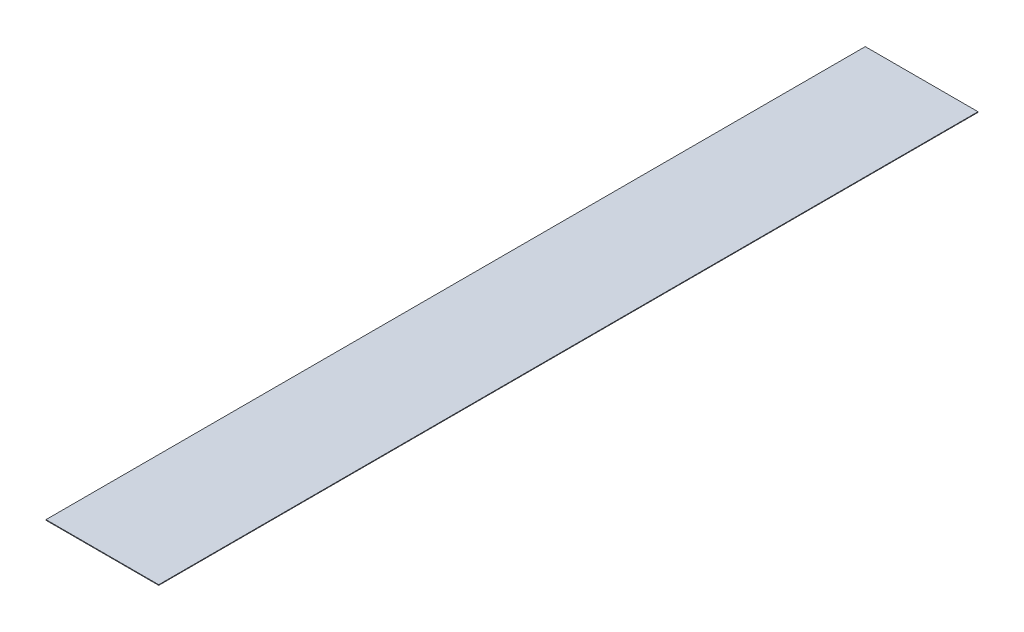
from build123d import *

# Parameters (mm, degrees)
SKETCH1_W           = 47.625
SKETCH1_H           = 346.075
BOSS_EXTRUDE1_DEPTH = 0.254


with BuildPart() as part:
    # Sketch1 → Boss-Extrude1 (new body)
    with BuildSketch(Plane(origin=(0, 0, 0), x_dir=(1, 0, 0), z_dir=(0, 1, 0))):
        with Locations((-23.8125, -173.0375)):
            Rectangle(SKETCH1_W, SKETCH1_H)
    extrude(amount=BOSS_EXTRUDE1_DEPTH)


solid = part.part
